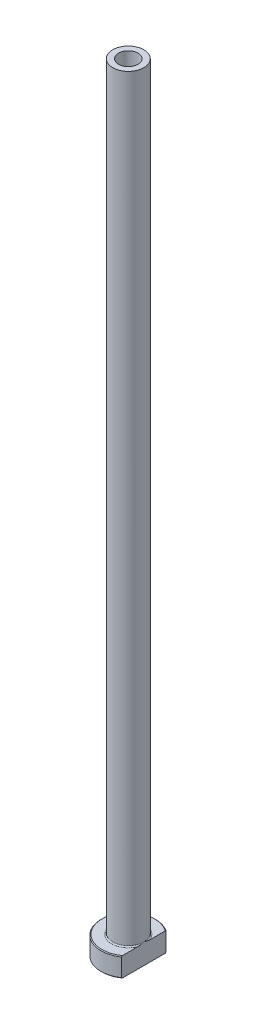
ISO-10303-21;
HEADER;
FILE_DESCRIPTION(('STEP AP214'),'2;1');
FILE_NAME('part.step','',(''),(''),'','','');
FILE_SCHEMA(('AUTOMOTIVE_DESIGN { 1 0 10303 214 1 1 1 1 }'));
ENDSEC;
DATA;
#1=APPLICATION_CONTEXT('core data for automotive mechanical design processes');
#2=APPLICATION_PROTOCOL_DEFINITION('international standard','automotive_design',2000,#1);
#3=PRODUCT_CONTEXT('',#1,'mechanical');
#4=PRODUCT('Part','Part','',(#3));
#5=PRODUCT_RELATED_PRODUCT_CATEGORY('part','',(#4));
#6=PRODUCT_DEFINITION_FORMATION('','',#4);
#7=PRODUCT_DEFINITION_CONTEXT('part definition',#1,'design');
#8=PRODUCT_DEFINITION('design','',#6,#7);
#9=PRODUCT_DEFINITION_SHAPE('','',#8);
#10=(LENGTH_UNIT() NAMED_UNIT(*) SI_UNIT(.MILLI.,.METRE.));
#11=(NAMED_UNIT(*) PLANE_ANGLE_UNIT() SI_UNIT($,.RADIAN.));
#12=(NAMED_UNIT(*) SI_UNIT($,.STERADIAN.) SOLID_ANGLE_UNIT());
#13=UNCERTAINTY_MEASURE_WITH_UNIT(LENGTH_MEASURE(1.E-05),#10,'distance_accuracy_value','');
#14=(GEOMETRIC_REPRESENTATION_CONTEXT(3) GLOBAL_UNCERTAINTY_ASSIGNED_CONTEXT((#13)) GLOBAL_UNIT_ASSIGNED_CONTEXT((#10,
#11,#12)) REPRESENTATION_CONTEXT('',''));
#15=CARTESIAN_POINT('',(0.,0.,0.));
#16=DIRECTION('',(0.,0.,1.));
#17=DIRECTION('',(1.,0.,0.));
#18=AXIS2_PLACEMENT_3D('',#15,#16,#17);
#19=CARTESIAN_POINT('',(0.,92.1876809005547,0.));
#20=DIRECTION('',(0.,1.,0.));
#21=DIRECTION('',(0.,0.,1.));
#22=AXIS2_PLACEMENT_3D('',#19,#20,#21);
#23=CYLINDRICAL_SURFACE('',#22,2.5);
#24=CARTESIAN_POINT('',(0.,200.,0.));
#25=DIRECTION('',(0.,1.,0.));
#26=DIRECTION('',(0.,0.,1.));
#27=AXIS2_PLACEMENT_3D('',#24,#25,#26);
#28=CIRCLE('',#27,2.5);
#29=CARTESIAN_POINT('',(0.,200.,2.5));
#30=VERTEX_POINT('',#29);
#31=EDGE_CURVE('E167',#30,#30,#28,.T.);
#32=ORIENTED_EDGE('',*,*,#31,.T.);
#33=EDGE_LOOP('',(#32));
#34=FACE_BOUND('',#33,.T.);
#35=CARTESIAN_POINT('',(0.,155.,0.));
#36=DIRECTION('',(0.,1.,0.));
#37=DIRECTION('',(0.,0.,1.));
#38=AXIS2_PLACEMENT_3D('',#35,#36,#37);
#39=CIRCLE('',#38,2.5);
#40=CARTESIAN_POINT('',(0.,155.,2.5));
#41=VERTEX_POINT('',#40);
#42=EDGE_CURVE('E170',#41,#41,#39,.T.);
#43=ORIENTED_EDGE('',*,*,#42,.F.);
#44=EDGE_LOOP('',(#43));
#45=FACE_BOUND('',#44,.T.);
#46=ADVANCED_FACE('F32',(#34,#45),#23,.F.);
#47=CARTESIAN_POINT('',(-2.5,200.,0.));
#48=DIRECTION('',(0.,1.,0.));
#49=DIRECTION('',(0.,0.,1.));
#50=AXIS2_PLACEMENT_3D('',#47,#48,#49);
#51=PLANE('',#50);
#52=CARTESIAN_POINT('',(0.,200.,0.));
#53=DIRECTION('',(0.,1.,0.));
#54=DIRECTION('',(0.,0.,1.));
#55=AXIS2_PLACEMENT_3D('',#52,#53,#54);
#56=CIRCLE('',#55,4.00000000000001);
#57=CARTESIAN_POINT('',(0.,200.,4.00000000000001));
#58=VERTEX_POINT('',#57);
#59=EDGE_CURVE('E174',#58,#58,#56,.T.);
#60=ORIENTED_EDGE('',*,*,#59,.T.);
#61=EDGE_LOOP('',(#60));
#62=FACE_BOUND('',#61,.T.);
#63=ORIENTED_EDGE('',*,*,#31,.F.);
#64=EDGE_LOOP('',(#63));
#65=FACE_BOUND('',#64,.T.);
#66=ADVANCED_FACE('F157',(#62,#65),#51,.T.);
#67=CARTESIAN_POINT('',(0.,92.1876809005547,0.));
#68=DIRECTION('',(0.,1.,0.));
#69=DIRECTION('',(0.,0.,1.));
#70=AXIS2_PLACEMENT_3D('',#67,#68,#69);
#71=CYLINDRICAL_SURFACE('',#70,4.);
#72=CARTESIAN_POINT('',(0.,5.3,0.));
#73=DIRECTION('',(0.,1.,0.));
#74=DIRECTION('',(0.,0.,1.));
#75=AXIS2_PLACEMENT_3D('',#72,#73,#74);
#76=CIRCLE('',#75,4.);
#77=CARTESIAN_POINT('',(4.,5.3,0.));
#78=VERTEX_POINT('',#77);
#79=EDGE_CURVE('E180',#78,#78,#76,.T.);
#80=ORIENTED_EDGE('',*,*,#79,.T.);
#81=EDGE_LOOP('',(#80));
#82=FACE_BOUND('',#81,.T.);
#83=ORIENTED_EDGE('',*,*,#59,.F.);
#84=EDGE_LOOP('',(#83));
#85=FACE_BOUND('',#84,.T.);
#86=ADVANCED_FACE('F162',(#82,#85),#71,.T.);
#87=CARTESIAN_POINT('',(-3.99999999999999,5.,0.));
#88=DIRECTION('',(0.,1.,0.));
#89=DIRECTION('',(0.,0.,1.));
#90=AXIS2_PLACEMENT_3D('',#87,#88,#89);
#91=PLANE('',#90);
#92=DIRECTION('',(0.,0.,1.));
#93=VECTOR('',#92,1.);
#94=CARTESIAN_POINT('',(4.,5.,0.));
#95=LINE('',#94,#93);
#96=CARTESIAN_POINT('',(4.,5.,-5.49909083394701));
#97=VERTEX_POINT('',#96);
#98=CARTESIAN_POINT('',(4.,5.,-1.57797338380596));
#99=VERTEX_POINT('',#98);
#100=EDGE_CURVE('E54',#97,#99,#95,.T.);
#101=ORIENTED_EDGE('',*,*,#100,.F.);
#102=CARTESIAN_POINT('',(0.,5.,0.));
#103=DIRECTION('',(0.,1.,0.));
#104=DIRECTION('',(0.,0.,1.));
#105=AXIS2_PLACEMENT_3D('',#102,#103,#104);
#106=CIRCLE('',#105,6.8);
#107=CARTESIAN_POINT('',(3.99999999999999,5.,5.49909083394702));
#108=VERTEX_POINT('',#107);
#109=EDGE_CURVE('E186',#97,#108,#106,.T.);
#110=ORIENTED_EDGE('',*,*,#109,.T.);
#111=CARTESIAN_POINT('',(4.,5.,1.57797338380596));
#112=VERTEX_POINT('',#111);
#113=EDGE_CURVE('E134',#112,#108,#95,.T.);
#114=ORIENTED_EDGE('',*,*,#113,.F.);
#115=CARTESIAN_POINT('',(0.,5.,0.));
#116=DIRECTION('',(0.,1.,0.));
#117=DIRECTION('',(0.,0.,1.));
#118=AXIS2_PLACEMENT_3D('',#115,#116,#117);
#119=CIRCLE('',#118,4.3);
#120=EDGE_CURVE('E183',#112,#99,#119,.F.);
#121=ORIENTED_EDGE('',*,*,#120,.T.);
#122=EDGE_LOOP('',(#101,#110,#114,#121));
#123=FACE_BOUND('',#122,.T.);
#124=ADVANCED_FACE('F197',(#123),#91,.T.);
#125=CARTESIAN_POINT('',(0.,92.1876809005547,0.));
#126=DIRECTION('',(0.,1.,0.));
#127=DIRECTION('',(0.,0.,1.));
#128=AXIS2_PLACEMENT_3D('',#125,#126,#127);
#129=CYLINDRICAL_SURFACE('',#128,6.99999999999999);
#130=DIRECTION('',(0.,-1.,0.));
#131=VECTOR('',#130,1.);
#132=CARTESIAN_POINT('',(3.99999999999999,200.,5.74456264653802));
#133=LINE('',#132,#131);
#134=CARTESIAN_POINT('',(3.99999999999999,4.8,5.74456264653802));
#135=VERTEX_POINT('',#134);
#136=CARTESIAN_POINT('',(3.99999999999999,0.20000000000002,5.74456264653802));
#137=VERTEX_POINT('',#136);
#138=EDGE_CURVE('E82',#135,#137,#133,.T.);
#139=ORIENTED_EDGE('',*,*,#138,.F.);
#140=CARTESIAN_POINT('',(0.,4.8,0.));
#141=DIRECTION('',(0.,1.,0.));
#142=DIRECTION('',(0.,0.,1.));
#143=AXIS2_PLACEMENT_3D('',#140,#141,#142);
#144=CIRCLE('',#143,6.99999999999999);
#145=CARTESIAN_POINT('',(4.,4.8,-5.74456264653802));
#146=VERTEX_POINT('',#145);
#147=EDGE_CURVE('E95',#135,#146,#144,.F.);
#148=ORIENTED_EDGE('',*,*,#147,.T.);
#149=DIRECTION('',(0.,-1.,0.));
#150=VECTOR('',#149,1.);
#151=CARTESIAN_POINT('',(4.,200.,-5.74456264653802));
#152=LINE('',#151,#150);
#153=CARTESIAN_POINT('',(4.,0.20000000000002,-5.74456264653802));
#154=VERTEX_POINT('',#153);
#155=EDGE_CURVE('E192',#146,#154,#152,.T.);
#156=ORIENTED_EDGE('',*,*,#155,.T.);
#157=CARTESIAN_POINT('',(0.,0.20000000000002,0.));
#158=DIRECTION('',(0.,-1.,0.));
#159=DIRECTION('',(0.,0.,-1.));
#160=AXIS2_PLACEMENT_3D('',#157,#158,#159);
#161=CIRCLE('',#160,6.99999999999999);
#162=EDGE_CURVE('E98',#154,#137,#161,.F.);
#163=ORIENTED_EDGE('',*,*,#162,.T.);
#164=EDGE_LOOP('',(#139,#148,#156,#163));
#165=FACE_BOUND('',#164,.T.);
#166=ADVANCED_FACE('F190',(#165),#129,.T.);
#167=CARTESIAN_POINT('',(-6.99999999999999,0.,0.));
#168=DIRECTION('',(0.,-1.,0.));
#169=DIRECTION('',(0.,0.,-1.));
#170=AXIS2_PLACEMENT_3D('',#167,#168,#169);
#171=PLANE('',#170);
#172=CARTESIAN_POINT('',(0.,0.,0.));
#173=DIRECTION('',(0.,-1.,0.));
#174=DIRECTION('',(0.,0.,-1.));
#175=AXIS2_PLACEMENT_3D('',#172,#173,#174);
#176=CIRCLE('',#175,3.25);
#177=CARTESIAN_POINT('',(0.,0.,-3.25));
#178=VERTEX_POINT('',#177);
#179=EDGE_CURVE('E40',#178,#178,#176,.F.);
#180=ORIENTED_EDGE('',*,*,#179,.T.);
#181=EDGE_LOOP('',(#180));
#182=FACE_BOUND('',#181,.T.);
#183=DIRECTION('',(0.,0.,-1.));
#184=VECTOR('',#183,1.);
#185=CARTESIAN_POINT('',(3.99999999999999,0.,5.74456264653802));
#186=LINE('',#185,#184);
#187=CARTESIAN_POINT('',(3.99999999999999,0.,5.49909083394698));
#188=VERTEX_POINT('',#187);
#189=CARTESIAN_POINT('',(4.,0.,-5.49909083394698));
#190=VERTEX_POINT('',#189);
#191=EDGE_CURVE('E47',#188,#190,#186,.T.);
#192=ORIENTED_EDGE('',*,*,#191,.F.);
#193=CARTESIAN_POINT('',(0.,0.,0.));
#194=DIRECTION('',(0.,-1.,0.));
#195=DIRECTION('',(0.,0.,-1.));
#196=AXIS2_PLACEMENT_3D('',#193,#194,#195);
#197=CIRCLE('',#196,6.79999999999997);
#198=EDGE_CURVE('E92',#188,#190,#197,.T.);
#199=ORIENTED_EDGE('',*,*,#198,.T.);
#200=EDGE_LOOP('',(#192,#199));
#201=FACE_BOUND('',#200,.T.);
#202=ADVANCED_FACE('F91',(#182,#201),#171,.T.);
#203=CARTESIAN_POINT('',(0.,92.1876809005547,0.));
#204=DIRECTION('',(0.,1.,0.));
#205=DIRECTION('',(0.,0.,1.));
#206=AXIS2_PLACEMENT_3D('',#203,#204,#205);
#207=CYLINDRICAL_SURFACE('',#206,2.75);
#208=CARTESIAN_POINT('',(0.,0.500000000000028,0.));
#209=DIRECTION('',(0.,-1.,0.));
#210=DIRECTION('',(0.,0.,-1.));
#211=AXIS2_PLACEMENT_3D('',#208,#209,#210);
#212=CIRCLE('',#211,2.75);
#213=CARTESIAN_POINT('',(0.,0.500000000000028,-2.75));
#214=VERTEX_POINT('',#213);
#215=EDGE_CURVE('E11',#214,#214,#212,.T.);
#216=ORIENTED_EDGE('',*,*,#215,.T.);
#217=EDGE_LOOP('',(#216));
#218=FACE_BOUND('',#217,.T.);
#219=CARTESIAN_POINT('',(0.,143.,0.));
#220=DIRECTION('',(0.,1.,0.));
#221=DIRECTION('',(0.,0.,1.));
#222=AXIS2_PLACEMENT_3D('',#219,#220,#221);
#223=CIRCLE('',#222,2.75000000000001);
#224=CARTESIAN_POINT('',(0.,143.,2.75000000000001));
#225=VERTEX_POINT('',#224);
#226=EDGE_CURVE('E172',#225,#225,#223,.T.);
#227=ORIENTED_EDGE('',*,*,#226,.T.);
#228=EDGE_LOOP('',(#227));
#229=FACE_BOUND('',#228,.T.);
#230=ADVANCED_FACE('F215',(#218,#229),#207,.F.);
#231=CARTESIAN_POINT('',(0.,143.,0.));
#232=DIRECTION('',(0.,-1.,0.));
#233=DIRECTION('',(0.,0.,-1.));
#234=AXIS2_PLACEMENT_3D('',#231,#232,#233);
#235=CONICAL_SURFACE('',#234,2.75000000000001,0.0208303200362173);
#236=ORIENTED_EDGE('',*,*,#42,.T.);
#237=EDGE_LOOP('',(#236));
#238=FACE_BOUND('',#237,.T.);
#239=ORIENTED_EDGE('',*,*,#226,.F.);
#240=EDGE_LOOP('',(#239));
#241=FACE_BOUND('',#240,.T.);
#242=ADVANCED_FACE('F111',(#238,#241),#235,.F.);
#243=CARTESIAN_POINT('',(0.,5.3,0.));
#244=DIRECTION('',(0.,1.,0.));
#245=DIRECTION('',(0.,0.,1.));
#246=AXIS2_PLACEMENT_3D('',#243,#244,#245);
#247=TOROIDAL_SURFACE('',#246,4.3,0.3);
#248=ORIENTED_EDGE('',*,*,#120,.F.);
#249=CARTESIAN_POINT('',(4.,5.3,0.));
#250=CARTESIAN_POINT('',(4.,5.30000062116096,-1.06261387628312E-10));
#251=CARTESIAN_POINT('',(4.,5.30000124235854,2.17726101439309E-07));
#252=CARTESIAN_POINT('',(4.,5.30000240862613,8.36141079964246E-07));
#253=CARTESIAN_POINT('',(4.,5.30000294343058,1.25011689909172E-06));
#254=CARTESIAN_POINT('',(4.,5.30000404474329,2.23959350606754E-06));
#255=CARTESIAN_POINT('',(4.,5.30000459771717,2.83084478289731E-06));
#256=CARTESIAN_POINT('',(4.,5.30000559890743,4.06516620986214E-06));
#257=CARTESIAN_POINT('',(4.,5.30000604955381,4.70640099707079E-06));
#258=CARTESIAN_POINT('',(4.,5.3000076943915,7.15677236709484E-06));
#259=CARTESIAN_POINT('',(4.,5.30000879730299,9.02996012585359E-06));
#260=CARTESIAN_POINT('',(4.,5.30001063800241,1.27664891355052E-05));
#261=CARTESIAN_POINT('',(4.,5.30001139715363,1.46197810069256E-05));
#262=CARTESIAN_POINT('',(4.,5.30001453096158,2.23679229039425E-05));
#263=CARTESIAN_POINT('',(4.,5.30001683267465,2.82968759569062E-05));
#264=CARTESIAN_POINT('',(4.,5.30002027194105,3.95668741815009E-05));
#265=CARTESIAN_POINT('',(4.,5.30002152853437,4.48715472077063E-05));
#266=CARTESIAN_POINT('',(4.,5.30003060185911,8.40118217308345E-05));
#267=CARTESIAN_POINT('',(4.,5.30003739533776,0.000118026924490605));
#268=CARTESIAN_POINT('',(4.,5.30006713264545,0.000252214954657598));
#269=CARTESIAN_POINT('',(4.,5.30009559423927,0.000351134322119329));
#270=CARTESIAN_POINT('',(3.99999999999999,5.30020622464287,0.000742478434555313));
#271=CARTESIAN_POINT('',(4.,5.30028475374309,0.00103561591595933));
#272=CARTESIAN_POINT('',(4.,5.30059889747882,0.00219920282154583));
#273=CARTESIAN_POINT('',(4.,5.30083905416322,0.00306873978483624));
#274=CARTESIAN_POINT('',(3.99999999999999,5.30183682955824,0.00669141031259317));
#275=CARTESIAN_POINT('',(4.,5.30258877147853,0.00944568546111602));
#276=CARTESIAN_POINT('',(4.,5.31066890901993,0.0390293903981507));
#277=CARTESIAN_POINT('',(4.,5.31802631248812,0.0658531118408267));
#278=CARTESIAN_POINT('',(3.99999999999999,5.33239676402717,0.118441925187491));
#279=CARTESIAN_POINT('',(4.,5.3394118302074,0.144206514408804));
#280=CARTESIAN_POINT('',(4.,5.35427366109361,0.19901759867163));
#281=CARTESIAN_POINT('',(4.,5.36211313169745,0.228066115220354));
#282=CARTESIAN_POINT('',(4.,5.37776349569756,0.286511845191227));
#283=CARTESIAN_POINT('',(4.,5.38557313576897,0.315909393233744));
#284=CARTESIAN_POINT('',(4.,5.40425662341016,0.386994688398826));
#285=CARTESIAN_POINT('',(4.,5.41505237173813,0.428703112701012));
#286=CARTESIAN_POINT('',(4.,5.43592310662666,0.511098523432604));
#287=CARTESIAN_POINT('',(4.,5.4460096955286,0.551782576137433));
#288=CARTESIAN_POINT('',(4.,5.47850986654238,0.686599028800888));
#289=CARTESIAN_POINT('',(4.,5.49978370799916,0.78101186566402));
#290=CARTESIAN_POINT('',(4.,5.53807543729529,0.971847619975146));
#291=CARTESIAN_POINT('',(4.,5.55504273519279,1.06828120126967));
#292=CARTESIAN_POINT('',(4.,5.5758240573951,1.21752725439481));
#293=CARTESIAN_POINT('',(4.,5.5820979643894,1.26999379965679));
#294=CARTESIAN_POINT('',(4.,5.59210686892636,1.37516324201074));
#295=CARTESIAN_POINT('',(4.,5.59584265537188,1.42786606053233));
#296=CARTESIAN_POINT('',(4.,5.60010438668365,1.53310673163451));
#297=CARTESIAN_POINT('',(4.,5.6006487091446,1.58564378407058));
#298=CARTESIAN_POINT('',(4.,5.59767158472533,1.69058605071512));
#299=CARTESIAN_POINT('',(4.,5.59415502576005,1.74299134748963));
#300=CARTESIAN_POINT('',(4.,5.58503062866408,1.81903290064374));
#301=CARTESIAN_POINT('',(4.,5.58157617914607,1.84292934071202));
#302=CARTESIAN_POINT('',(4.,5.57329952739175,1.89051061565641));
#303=CARTESIAN_POINT('',(4.,5.56847619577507,1.91419525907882));
#304=CARTESIAN_POINT('',(4.,5.55726644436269,1.9609288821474));
#305=CARTESIAN_POINT('',(4.,5.550897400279,1.98398195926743));
#306=CARTESIAN_POINT('',(4.,5.53623434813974,2.02945550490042));
#307=CARTESIAN_POINT('',(4.,5.52794253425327,2.05187666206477));
#308=CARTESIAN_POINT('',(4.,5.50887098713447,2.09590631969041));
#309=CARTESIAN_POINT('',(4.,5.49806837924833,2.11750508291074));
#310=CARTESIAN_POINT('',(4.,5.47333401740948,2.15885583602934));
#311=CARTESIAN_POINT('',(4.,5.459412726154,2.17861369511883));
#312=CARTESIAN_POINT('',(4.,5.43588221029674,2.20522942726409));
#313=CARTESIAN_POINT('',(4.,5.42781139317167,2.21344043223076));
#314=CARTESIAN_POINT('',(4.,5.41065114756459,2.22875149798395));
#315=CARTESIAN_POINT('',(4.,5.4015612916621,2.23585108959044));
#316=CARTESIAN_POINT('',(4.,5.38220524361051,2.24859694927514));
#317=CARTESIAN_POINT('',(4.,5.37192420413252,2.25422119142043));
#318=CARTESIAN_POINT('',(4.,5.35045072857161,2.26331064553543));
#319=CARTESIAN_POINT('',(4.,5.33926122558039,2.26678251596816));
#320=CARTESIAN_POINT('',(4.,5.3195204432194,2.2705126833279));
#321=CARTESIAN_POINT('',(4.,5.31108453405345,2.27139016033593));
#322=CARTESIAN_POINT('',(4.,5.29418624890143,2.27168963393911));
#323=CARTESIAN_POINT('',(4.,5.2857238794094,2.27111196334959));
#324=CARTESIAN_POINT('',(4.,5.26904138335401,2.26855580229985));
#325=CARTESIAN_POINT('',(4.,5.26082066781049,2.26658107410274));
#326=CARTESIAN_POINT('',(4.,5.24478214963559,2.26139496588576));
#327=CARTESIAN_POINT('',(4.,5.23696461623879,2.25818277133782));
#328=CARTESIAN_POINT('',(4.,5.2185123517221,2.24908332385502));
#329=CARTESIAN_POINT('',(4.,5.20815219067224,2.24264095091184));
#330=CARTESIAN_POINT('',(4.,5.18857975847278,2.22819957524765));
#331=CARTESIAN_POINT('',(4.,5.17937061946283,2.22019647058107));
#332=CARTESIAN_POINT('',(4.,5.15665383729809,2.19777756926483));
#333=CARTESIAN_POINT('',(4.,5.14403484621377,2.18246908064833));
#334=CARTESIAN_POINT('',(4.,5.12118369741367,2.15020843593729));
#335=CARTESIAN_POINT('',(4.,5.11095480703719,2.13325407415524));
#336=CARTESIAN_POINT('',(4.,5.09273574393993,2.09892324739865));
#337=CARTESIAN_POINT('',(4.,5.08468212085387,2.08157988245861));
#338=CARTESIAN_POINT('',(4.,5.07005901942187,2.04627072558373));
#339=CARTESIAN_POINT('',(4.,5.06349101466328,2.02830433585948));
#340=CARTESIAN_POINT('',(4.,5.04555485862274,1.9735076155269));
#341=CARTESIAN_POINT('',(4.,5.03608974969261,1.93605770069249));
#342=CARTESIAN_POINT('',(4.,5.01780569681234,1.84529235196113));
#343=CARTESIAN_POINT('',(4.,5.01077018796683,1.79164082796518));
#344=CARTESIAN_POINT('',(4.,5.00182846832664,1.68379947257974));
#345=CARTESIAN_POINT('',(4.,4.99993887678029,1.62960846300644));
#346=CARTESIAN_POINT('',(4.,5.0000612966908,1.52361204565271));
#347=CARTESIAN_POINT('',(4.,5.00190698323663,1.47180551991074));
#348=CARTESIAN_POINT('',(4.,5.00841243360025,1.36835357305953));
#349=CARTESIAN_POINT('',(4.,5.01307376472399,1.31670825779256));
#350=CARTESIAN_POINT('',(4.,5.02905484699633,1.17431887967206));
#351=CARTESIAN_POINT('',(4.,5.04274090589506,1.08384207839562));
#352=CARTESIAN_POINT('',(4.,5.06701714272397,0.9477579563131));
#353=CARTESIAN_POINT('',(4.,5.07585573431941,0.90181406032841));
#354=CARTESIAN_POINT('',(4.,5.09458665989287,0.810008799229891));
#355=CARTESIAN_POINT('',(4.,5.10448180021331,0.764148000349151));
#356=CARTESIAN_POINT('',(4.,5.12892434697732,0.655631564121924));
#357=CARTESIAN_POINT('',(4.,5.14383556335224,0.593058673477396));
#358=CARTESIAN_POINT('',(4.,5.17458762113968,0.468885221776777));
#359=CARTESIAN_POINT('',(4.,5.19041623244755,0.407281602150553));
#360=CARTESIAN_POINT('',(3.99999999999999,5.22090834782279,0.291232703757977));
#361=CARTESIAN_POINT('',(3.99999999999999,5.23550024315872,0.236768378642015));
#362=CARTESIAN_POINT('',(4.,5.26562550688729,0.125604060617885));
#363=CARTESIAN_POINT('',(4.,5.28117250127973,0.0689076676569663));
#364=CARTESIAN_POINT('',(4.,5.29741226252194,0.00944154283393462));
#365=CARTESIAN_POINT('',(3.99999999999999,5.29816540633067,0.0066831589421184));
#366=CARTESIAN_POINT('',(4.,5.29916346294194,0.0030595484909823));
#367=CARTESIAN_POINT('',(4.,5.2994027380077,0.00219318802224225));
#368=CARTESIAN_POINT('',(4.,5.29971580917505,0.00103357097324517));
#369=CARTESIAN_POINT('',(3.99999999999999,5.29979412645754,0.000741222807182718));
#370=CARTESIAN_POINT('',(4.,5.29990450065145,0.00035080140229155));
#371=CARTESIAN_POINT('',(4.,5.29993292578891,0.000252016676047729));
#372=CARTESIAN_POINT('',(4.,5.2999626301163,0.000117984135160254));
#373=CARTESIAN_POINT('',(4.,5.29996941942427,8.39881910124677E-05));
#374=CARTESIAN_POINT('',(4.,5.29997848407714,4.48674022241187E-05));
#375=CARTESIAN_POINT('',(4.,5.29997973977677,3.95638197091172E-05));
#376=CARTESIAN_POINT('',(4.,5.29998317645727,2.82960343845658E-05));
#377=CARTESIAN_POINT('',(4.,5.29998547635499,2.23681459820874E-05));
#378=CARTESIAN_POINT('',(4.,5.2999886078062,1.46211003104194E-05));
#379=CARTESIAN_POINT('',(4.,5.29998936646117,1.27678901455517E-05));
#380=CARTESIAN_POINT('',(4.,5.29999120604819,9.03144064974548E-06));
#381=CARTESIAN_POINT('',(4.,5.29999230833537,7.15824096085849E-06));
#382=CARTESIAN_POINT('',(4.,5.29999395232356,4.70775527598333E-06));
#383=CARTESIAN_POINT('',(4.,5.29999440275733,4.06646391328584E-06));
#384=CARTESIAN_POINT('',(4.,5.29999540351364,2.83199096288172E-06));
#385=CARTESIAN_POINT('',(4.,5.29999595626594,2.24064351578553E-06));
#386=CARTESIAN_POINT('',(4.,5.29999705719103,1.25093979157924E-06));
#387=CARTESIAN_POINT('',(4.,5.29999759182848,8.36841135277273E-07));
#388=CARTESIAN_POINT('',(4.,5.29999875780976,2.18117782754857E-07));
#389=CARTESIAN_POINT('',(4.,5.29999937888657,1.06254464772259E-10));
#390=CARTESIAN_POINT('',(4.,5.3,0.));
#391=B_SPLINE_CURVE_WITH_KNOTS('',3,(#249,#250,#251,#252,#253,#254,#255,#256,#257,#258,#259,
#260,#261,#262,#263,#264,#265,#266,#267,#268,#269,#270,#271,#272,#273,#274,#275,#276,#277,#278,
#279,#280,#281,#282,#283,#284,#285,#286,#287,#288,#289,#290,#291,#292,#293,#294,#295,#296,#297,
#298,#299,#300,#301,#302,#303,#304,#305,#306,#307,#308,#309,#310,#311,#312,#313,#314,#315,#316,
#317,#318,#319,#320,#321,#322,#323,#324,#325,#326,#327,#328,#329,#330,#331,#332,#333,#334,#335,
#336,#337,#338,#339,#340,#341,#342,#343,#344,#345,#346,#347,#348,#349,#350,#351,#352,#353,#354,
#355,#356,#357,#358,#359,#360,#361,#362,#363,#364,#365,#366,#367,#368,#369,#370,#371,#372,#373,
#374,#375,#376,#377,#378,#379,#380,#381,#382,#383,#384,#385,#386,#387,#388,#389,#390),
.UNSPECIFIED.,.T.,.F.,(4,2,2,2,2,2,2,2,2,2,2,2,2,2,2,2,2,2,2,2,2,2,2,2,2,2,2,2,2,2,2,2,2,2,2,2,
2,2,2,2,2,2,2,2,2,2,2,2,2,2,2,2,2,2,2,2,2,2,2,2,2,2,2,2,2,2,2,2,2,2,4),(0.,1.87484395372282E-06,
3.90179990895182E-06,6.31683803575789E-06,8.66651934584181E-06,1.51627551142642E-05,
2.11657928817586E-05,4.02090773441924E-05,5.65429468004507E-05,0.000160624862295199,
0.000469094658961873,0.00137985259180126,0.0040857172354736,0.0126514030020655,
0.0960918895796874,0.176200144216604,0.266463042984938,0.357714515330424,0.486961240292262,
0.612707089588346,0.902988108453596,1.19653589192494,1.35501075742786,1.51343634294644,
1.67094875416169,1.82827177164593,1.90067591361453,1.97313996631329,2.04482437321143,
2.11642737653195,2.18871023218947,2.26075412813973,2.29521947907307,2.32969934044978,
2.36466792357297,2.39952778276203,2.4248542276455,2.45017488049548,2.47542760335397,
2.5006969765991,2.53708899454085,2.57357798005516,2.63276032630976,2.69202310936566,
2.74930315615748,2.80663977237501,2.92223125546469,3.08420752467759,3.24670629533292,
3.4021285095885,3.55763731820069,3.83192962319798,3.9722838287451,4.11302057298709,
4.30598130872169,4.4967888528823,4.66594443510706,4.84230602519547,4.85088453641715,
4.85358051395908,4.85448881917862,4.85479687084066,4.85490089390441,4.85491722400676,
4.85493626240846,4.85494226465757,4.85494875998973,4.85495110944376,4.85495352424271,
4.85495555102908,4.85495742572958),.UNSPECIFIED.);
#392=EDGE_CURVE('E126',#112,#78,#391,.T.);
#393=ORIENTED_EDGE('',*,*,#392,.T.);
#394=ORIENTED_EDGE('',*,*,#79,.F.);
#395=CARTESIAN_POINT('',(4.,5.3,0.));
#396=CARTESIAN_POINT('',(4.,5.29999937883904,1.06262478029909E-10));
#397=CARTESIAN_POINT('',(4.,5.29999875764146,-2.17726100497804E-07));
#398=CARTESIAN_POINT('',(4.,5.29999759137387,-8.36141079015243E-07));
#399=CARTESIAN_POINT('',(4.,5.29999705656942,-1.25011689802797E-06));
#400=CARTESIAN_POINT('',(4.,5.29999595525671,-2.2395935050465E-06));
#401=CARTESIAN_POINT('',(4.,5.29999540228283,-2.83084478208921E-06));
#402=CARTESIAN_POINT('',(4.,5.29999440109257,-4.06516620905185E-06));
#403=CARTESIAN_POINT('',(4.,5.29999395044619,-4.70640099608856E-06));
#404=CARTESIAN_POINT('',(4.,5.2999923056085,-7.15677236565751E-06));
#405=CARTESIAN_POINT('',(4.,5.29999120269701,-9.02996012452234E-06));
#406=CARTESIAN_POINT('',(4.,5.29998936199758,-1.27664891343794E-05));
#407=CARTESIAN_POINT('',(4.,5.29998860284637,-1.46197810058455E-05));
#408=CARTESIAN_POINT('',(4.,5.29998546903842,-2.23679229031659E-05));
#409=CARTESIAN_POINT('',(4.,5.29998316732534,-2.82968759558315E-05));
#410=CARTESIAN_POINT('',(4.,5.29997972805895,-3.95668741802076E-05));
#411=CARTESIAN_POINT('',(4.,5.29997847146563,-4.48715472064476E-05));
#412=CARTESIAN_POINT('',(4.,5.29996939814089,-8.40118217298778E-05));
#413=CARTESIAN_POINT('',(4.,5.29996260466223,-0.000118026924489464));
#414=CARTESIAN_POINT('',(4.,5.29993286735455,-0.000252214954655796));
#415=CARTESIAN_POINT('',(4.,5.29990440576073,-0.000351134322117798));
#416=CARTESIAN_POINT('',(3.99999999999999,5.29979377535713,-0.000742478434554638));
#417=CARTESIAN_POINT('',(4.,5.29971524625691,-0.00103561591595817));
#418=CARTESIAN_POINT('',(4.,5.29940110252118,-0.0021992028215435));
#419=CARTESIAN_POINT('',(4.,5.29916094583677,-0.00306873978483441));
#420=CARTESIAN_POINT('',(3.99999999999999,5.29816317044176,-0.00669141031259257));
#421=CARTESIAN_POINT('',(4.,5.29741122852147,-0.00944568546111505));
#422=CARTESIAN_POINT('',(4.,5.28933109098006,-0.0390293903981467));
#423=CARTESIAN_POINT('',(4.,5.28197368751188,-0.0658531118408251));
#424=CARTESIAN_POINT('',(3.99999999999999,5.26760323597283,-0.118441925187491));
#425=CARTESIAN_POINT('',(4.,5.2605881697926,-0.144206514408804));
#426=CARTESIAN_POINT('',(4.,5.24572633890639,-0.19901759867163));
#427=CARTESIAN_POINT('',(4.,5.23788686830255,-0.228066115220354));
#428=CARTESIAN_POINT('',(4.,5.22223650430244,-0.286511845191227));
#429=CARTESIAN_POINT('',(4.,5.21442686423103,-0.315909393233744));
#430=CARTESIAN_POINT('',(4.,5.19574337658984,-0.386994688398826));
#431=CARTESIAN_POINT('',(4.,5.18494762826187,-0.428703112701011));
#432=CARTESIAN_POINT('',(4.,5.16407689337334,-0.511098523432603));
#433=CARTESIAN_POINT('',(4.,5.1539903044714,-0.551782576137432));
#434=CARTESIAN_POINT('',(4.,5.12149013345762,-0.686599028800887));
#435=CARTESIAN_POINT('',(4.,5.10021629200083,-0.781011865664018));
#436=CARTESIAN_POINT('',(4.,5.06192456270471,-0.971847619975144));
#437=CARTESIAN_POINT('',(4.,5.04495726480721,-1.06828120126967));
#438=CARTESIAN_POINT('',(4.,5.0241759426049,-1.2175272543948));
#439=CARTESIAN_POINT('',(4.,5.0179020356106,-1.26999379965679));
#440=CARTESIAN_POINT('',(4.,5.00789313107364,-1.37516324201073));
#441=CARTESIAN_POINT('',(4.,5.00415734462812,-1.42786606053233));
#442=CARTESIAN_POINT('',(4.,4.99989561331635,-1.53310673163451));
#443=CARTESIAN_POINT('',(4.,4.9993512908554,-1.58564378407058));
#444=CARTESIAN_POINT('',(4.,5.00232841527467,-1.69058605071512));
#445=CARTESIAN_POINT('',(4.,5.00584497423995,-1.74299134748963));
#446=CARTESIAN_POINT('',(4.,5.01496937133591,-1.81903290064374));
#447=CARTESIAN_POINT('',(4.,5.01842382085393,-1.84292934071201));
#448=CARTESIAN_POINT('',(4.,5.02670047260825,-1.89051061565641));
#449=CARTESIAN_POINT('',(4.,5.03152380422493,-1.91419525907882));
#450=CARTESIAN_POINT('',(4.,5.04273355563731,-1.96092888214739));
#451=CARTESIAN_POINT('',(4.,5.049102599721,-1.98398195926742));
#452=CARTESIAN_POINT('',(4.,5.06376565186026,-2.02945550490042));
#453=CARTESIAN_POINT('',(4.,5.07205746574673,-2.05187666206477));
#454=CARTESIAN_POINT('',(4.,5.09112901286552,-2.0959063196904));
#455=CARTESIAN_POINT('',(4.,5.10193162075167,-2.11750508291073));
#456=CARTESIAN_POINT('',(4.,5.12666598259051,-2.15885583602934));
#457=CARTESIAN_POINT('',(4.,5.140587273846,-2.17861369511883));
#458=CARTESIAN_POINT('',(4.,5.16411778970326,-2.20522942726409));
#459=CARTESIAN_POINT('',(4.,5.17218860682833,-2.21344043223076));
#460=CARTESIAN_POINT('',(4.,5.18934885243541,-2.22875149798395));
#461=CARTESIAN_POINT('',(4.,5.1984387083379,-2.23585108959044));
#462=CARTESIAN_POINT('',(4.,5.21779475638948,-2.24859694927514));
#463=CARTESIAN_POINT('',(4.,5.22807579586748,-2.25422119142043));
#464=CARTESIAN_POINT('',(4.,5.24954927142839,-2.26331064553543));
#465=CARTESIAN_POINT('',(4.,5.26073877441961,-2.26678251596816));
#466=CARTESIAN_POINT('',(4.,5.2804795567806,-2.2705126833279));
#467=CARTESIAN_POINT('',(4.,5.28891546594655,-2.27139016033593));
#468=CARTESIAN_POINT('',(4.,5.30581375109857,-2.27168963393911));
#469=CARTESIAN_POINT('',(4.,5.31427612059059,-2.27111196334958));
#470=CARTESIAN_POINT('',(4.,5.33095861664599,-2.26855580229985));
#471=CARTESIAN_POINT('',(4.,5.33917933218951,-2.26658107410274));
#472=CARTESIAN_POINT('',(4.,5.35521785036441,-2.26139496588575));
#473=CARTESIAN_POINT('',(4.,5.36303538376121,-2.25818277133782));
#474=CARTESIAN_POINT('',(4.,5.38148764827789,-2.24908332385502));
#475=CARTESIAN_POINT('',(4.,5.39184780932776,-2.24264095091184));
#476=CARTESIAN_POINT('',(4.,5.41142024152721,-2.22819957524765));
#477=CARTESIAN_POINT('',(4.,5.42062938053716,-2.22019647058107));
#478=CARTESIAN_POINT('',(4.,5.44334616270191,-2.19777756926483));
#479=CARTESIAN_POINT('',(4.,5.45596515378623,-2.18246908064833));
#480=CARTESIAN_POINT('',(4.,5.47881630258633,-2.15020843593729));
#481=CARTESIAN_POINT('',(4.,5.48904519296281,-2.13325407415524));
#482=CARTESIAN_POINT('',(4.,5.50726425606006,-2.09892324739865));
#483=CARTESIAN_POINT('',(4.,5.51531787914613,-2.08157988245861));
#484=CARTESIAN_POINT('',(4.,5.52994098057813,-2.04627072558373));
#485=CARTESIAN_POINT('',(4.,5.53650898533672,-2.02830433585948));
#486=CARTESIAN_POINT('',(4.,5.55444514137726,-1.9735076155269));
#487=CARTESIAN_POINT('',(4.,5.56391025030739,-1.93605770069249));
#488=CARTESIAN_POINT('',(4.,5.58219430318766,-1.84529235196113));
#489=CARTESIAN_POINT('',(4.,5.58922981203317,-1.79164082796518));
#490=CARTESIAN_POINT('',(4.,5.59817153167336,-1.68379947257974));
#491=CARTESIAN_POINT('',(4.,5.60006112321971,-1.62960846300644));
#492=CARTESIAN_POINT('',(4.,5.5999387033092,-1.52361204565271));
#493=CARTESIAN_POINT('',(4.,5.59809301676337,-1.47180551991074));
#494=CARTESIAN_POINT('',(4.,5.59158756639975,-1.36835357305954));
#495=CARTESIAN_POINT('',(4.,5.58692623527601,-1.31670825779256));
#496=CARTESIAN_POINT('',(4.,5.57094515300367,-1.17431887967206));
#497=CARTESIAN_POINT('',(4.,5.55725909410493,-1.08384207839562));
#498=CARTESIAN_POINT('',(4.,5.53298285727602,-0.947757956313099));
#499=CARTESIAN_POINT('',(4.,5.52414426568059,-0.901814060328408));
#500=CARTESIAN_POINT('',(4.,5.50541334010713,-0.81000879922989));
#501=CARTESIAN_POINT('',(4.,5.49551819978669,-0.764148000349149));
#502=CARTESIAN_POINT('',(4.,5.47107565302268,-0.655631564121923));
#503=CARTESIAN_POINT('',(4.,5.45616443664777,-0.593058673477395));
#504=CARTESIAN_POINT('',(4.,5.42541237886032,-0.468885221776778));
#505=CARTESIAN_POINT('',(4.,5.40958376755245,-0.407281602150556));
#506=CARTESIAN_POINT('',(3.99999999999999,5.37909165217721,-0.291232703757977));
#507=CARTESIAN_POINT('',(3.99999999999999,5.3644997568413,-0.236768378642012));
#508=CARTESIAN_POINT('',(4.,5.33437449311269,-0.12560406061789));
#509=CARTESIAN_POINT('',(4.,5.3188274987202,-0.0689076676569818));
#510=CARTESIAN_POINT('',(4.,5.30258773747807,-0.00944154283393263));
#511=CARTESIAN_POINT('',(3.99999999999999,5.30183459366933,-0.0066831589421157));
#512=CARTESIAN_POINT('',(4.,5.30083653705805,-0.00305954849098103));
#513=CARTESIAN_POINT('',(4.,5.3005972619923,-0.00219318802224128));
#514=CARTESIAN_POINT('',(4.,5.30028419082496,-0.00103357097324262));
#515=CARTESIAN_POINT('',(3.99999999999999,5.30020587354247,-0.000741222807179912));
#516=CARTESIAN_POINT('',(4.,5.30009549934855,-0.000350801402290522));
#517=CARTESIAN_POINT('',(4.,5.30006707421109,-0.000252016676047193));
#518=CARTESIAN_POINT('',(4.,5.3000373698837,-0.000117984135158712));
#519=CARTESIAN_POINT('',(4.,5.30003058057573,-8.39881910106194E-05));
#520=CARTESIAN_POINT('',(4.,5.30002151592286,-4.48674022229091E-05));
#521=CARTESIAN_POINT('',(4.,5.30002026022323,-3.95638197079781E-05));
#522=CARTESIAN_POINT('',(4.,5.30001682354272,-2.8296034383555E-05));
#523=CARTESIAN_POINT('',(4.,5.30001452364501,-2.23681459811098E-05));
#524=CARTESIAN_POINT('',(4.,5.3000113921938,-1.46211003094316E-05));
#525=CARTESIAN_POINT('',(4.,5.30001063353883,-1.27678901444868E-05));
#526=CARTESIAN_POINT('',(4.,5.30000879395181,-9.03144064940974E-06));
#527=CARTESIAN_POINT('',(4.,5.30000769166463,-7.15824096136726E-06));
#528=CARTESIAN_POINT('',(4.,5.30000604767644,-4.70775527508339E-06));
#529=CARTESIAN_POINT('',(4.,5.30000559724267,-4.06646391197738E-06));
#530=CARTESIAN_POINT('',(4.,5.30000459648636,-2.83199096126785E-06));
#531=CARTESIAN_POINT('',(4.,5.30000404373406,-2.24064351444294E-06));
#532=CARTESIAN_POINT('',(4.,5.30000294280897,-1.25093979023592E-06));
#533=CARTESIAN_POINT('',(4.,5.30000240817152,-8.36841133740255E-07));
#534=CARTESIAN_POINT('',(4.,5.30000124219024,-2.1811778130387E-07));
#535=CARTESIAN_POINT('',(4.,5.30000062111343,-1.06253139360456E-10));
#536=CARTESIAN_POINT('',(4.,5.3,0.));
#537=B_SPLINE_CURVE_WITH_KNOTS('',3,(#395,#396,#397,#398,#399,#400,#401,#402,#403,#404,#405,
#406,#407,#408,#409,#410,#411,#412,#413,#414,#415,#416,#417,#418,#419,#420,#421,#422,#423,#424,
#425,#426,#427,#428,#429,#430,#431,#432,#433,#434,#435,#436,#437,#438,#439,#440,#441,#442,#443,
#444,#445,#446,#447,#448,#449,#450,#451,#452,#453,#454,#455,#456,#457,#458,#459,#460,#461,#462,
#463,#464,#465,#466,#467,#468,#469,#470,#471,#472,#473,#474,#475,#476,#477,#478,#479,#480,#481,
#482,#483,#484,#485,#486,#487,#488,#489,#490,#491,#492,#493,#494,#495,#496,#497,#498,#499,#500,
#501,#502,#503,#504,#505,#506,#507,#508,#509,#510,#511,#512,#513,#514,#515,#516,#517,#518,#519,
#520,#521,#522,#523,#524,#525,#526,#527,#528,#529,#530,#531,#532,#533,#534,#535,#536),
.UNSPECIFIED.,.T.,.F.,(4,2,2,2,2,2,2,2,2,2,2,2,2,2,2,2,2,2,2,2,2,2,2,2,2,2,2,2,2,2,2,2,2,2,2,2,
2,2,2,2,2,2,2,2,2,2,2,2,2,2,2,2,2,2,2,2,2,2,2,2,2,2,2,2,2,2,2,2,2,2,4),(0.,1.87484395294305E-06,
3.90179990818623E-06,6.31683803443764E-06,8.66651934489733E-06,1.51627551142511E-05,
2.1165792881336E-05,4.02090773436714E-05,5.65429467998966E-05,0.000160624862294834,
0.000469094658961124,0.00137985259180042,0.00408571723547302,0.0126514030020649,
0.0960918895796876,0.176200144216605,0.266463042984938,0.357714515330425,0.486961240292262,
0.612707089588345,0.902988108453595,1.19653589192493,1.35501075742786,1.51343634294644,
1.67094875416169,1.82827177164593,1.90067591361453,1.97313996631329,2.04482437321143,
2.11642737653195,2.18871023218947,2.26075412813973,2.29521947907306,2.32969934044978,
2.36466792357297,2.39952778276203,2.4248542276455,2.45017488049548,2.47542760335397,
2.5006969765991,2.53708899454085,2.57357798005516,2.63276032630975,2.69202310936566,
2.74930315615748,2.80663977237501,2.92223125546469,3.08420752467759,3.24670629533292,
3.4021285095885,3.55763731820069,3.83192962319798,3.9722838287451,4.11302057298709,
4.30598130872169,4.4967888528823,4.66594443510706,4.84230602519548,4.85088453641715,
4.85358051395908,4.85448881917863,4.85479687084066,4.85490089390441,4.85491722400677,
4.85493626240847,4.85494226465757,4.85494875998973,4.85495110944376,4.85495352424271,
4.85495555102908,4.85495742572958),.UNSPECIFIED.);
#538=EDGE_CURVE('E135',#78,#99,#537,.T.);
#539=ORIENTED_EDGE('',*,*,#538,.T.);
#540=EDGE_LOOP('',(#248,#393,#394,#539));
#541=FACE_BOUND('',#540,.T.);
#542=ADVANCED_FACE('F141',(#541),#247,.F.);
#543=CARTESIAN_POINT('',(0.,5.,0.));
#544=DIRECTION('',(0.,-1.,0.));
#545=DIRECTION('',(0.,0.,-1.));
#546=AXIS2_PLACEMENT_3D('',#543,#544,#545);
#547=CONICAL_SURFACE('',#546,6.8,0.785398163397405);
#548=CARTESIAN_POINT('',(4.,-1.45712845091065,-12.6392822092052));
#549=CARTESIAN_POINT('',(4.,-1.24364466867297,-12.4153556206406));
#550=CARTESIAN_POINT('',(4.,-1.03042430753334,-12.1911774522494));
#551=CARTESIAN_POINT('',(4.,-0.604617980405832,-11.7422167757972));
#552=CARTESIAN_POINT('',(4.,-0.392032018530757,-11.5174342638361));
#553=CARTESIAN_POINT('',(4.,0.0324624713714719,-11.0670952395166));
#554=CARTESIAN_POINT('',(4.,0.244370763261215,-10.8415385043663));
#555=CARTESIAN_POINT('',(4.,0.667290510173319,-10.3895875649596));
#556=CARTESIAN_POINT('',(4.,0.878301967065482,-10.1631933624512));
#557=CARTESIAN_POINT('',(4.,1.51385375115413,-9.47810122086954));
#558=CARTESIAN_POINT('',(4.,1.93676291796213,-9.01788214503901));
#559=CARTESIAN_POINT('',(4.,2.56612335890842,-8.32309905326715));
#560=CARTESIAN_POINT('',(4.,2.77505666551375,-8.09078457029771));
#561=CARTESIAN_POINT('',(4.,3.19080254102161,-7.62426940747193));
#562=CARTESIAN_POINT('',(4.,3.39761512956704,-7.39006874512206));
#563=CARTESIAN_POINT('',(4.,3.87870763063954,-6.83891844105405));
#564=CARTESIAN_POINT('',(4.,4.15190978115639,-6.52102188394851));
#565=CARTESIAN_POINT('',(4.,4.55642425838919,-6.03960901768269));
#566=CARTESIAN_POINT('',(4.,4.69041050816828,-5.87833992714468));
#567=CARTESIAN_POINT('',(4.,4.95616531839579,-5.55398469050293));
#568=CARTESIAN_POINT('',(4.,5.08793391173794,-5.39089857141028));
#569=CARTESIAN_POINT('',(4.,5.3484171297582,-5.06288801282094));
#570=CARTESIAN_POINT('',(4.,5.47713786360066,-4.89796843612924));
#571=CARTESIAN_POINT('',(4.,5.73107494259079,-4.56545535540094));
#572=CARTESIAN_POINT('',(4.,5.85629144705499,-4.39786197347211));
#573=CARTESIAN_POINT('',(4.,6.10211465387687,-4.05948444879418));
#574=CARTESIAN_POINT('',(4.,6.22272435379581,-3.88870249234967));
#575=CARTESIAN_POINT('',(4.,6.45796076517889,-3.54308312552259));
#576=CARTESIAN_POINT('',(4.,6.57258867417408,-3.3682465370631));
#577=CARTESIAN_POINT('',(4.,6.76866603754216,-3.05381396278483));
#578=CARTESIAN_POINT('',(4.,6.85173773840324,-2.91523359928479));
#579=CARTESIAN_POINT('',(4.,7.01174537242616,-2.63451965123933));
#580=CARTESIAN_POINT('',(4.,7.08868042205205,-2.49238555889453));
#581=CARTESIAN_POINT('',(4.,7.23459437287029,-2.20416961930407));
#582=CARTESIAN_POINT('',(4.,7.30357836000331,-2.05809037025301));
#583=CARTESIAN_POINT('',(4.,7.43135520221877,-1.7615173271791));
#584=CARTESIAN_POINT('',(4.,7.49015114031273,-1.61102488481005));
#585=CARTESIAN_POINT('',(4.,7.58249315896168,-1.3414209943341));
#586=CARTESIAN_POINT('',(4.,7.61872660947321,-1.22323501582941));
#587=CARTESIAN_POINT('',(4.,7.68223354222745,-0.984492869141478));
#588=CARTESIAN_POINT('',(4.,7.70951040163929,-0.863937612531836));
#589=CARTESIAN_POINT('',(4.,7.75377914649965,-0.621342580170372));
#590=CARTESIAN_POINT('',(4.,7.77080509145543,-0.499309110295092));
#591=CARTESIAN_POINT('',(4.,7.79378778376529,-0.254194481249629));
#592=CARTESIAN_POINT('',(4.,7.79974523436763,-0.131113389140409));
#593=CARTESIAN_POINT('',(4.,7.80023957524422,0.11551726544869));
#594=CARTESIAN_POINT('',(4.,7.79473514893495,0.239066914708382));
#595=CARTESIAN_POINT('',(4.,7.7725511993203,0.485148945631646));
#596=CARTESIAN_POINT('',(4.,7.75587091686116,0.607681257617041));
#597=CARTESIAN_POINT('',(4.,7.71218353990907,0.851269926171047));
#598=CARTESIAN_POINT('',(4.,7.68514362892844,0.972320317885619));
#599=CARTESIAN_POINT('',(4.,7.62201202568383,1.21200276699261));
#600=CARTESIAN_POINT('',(4.,7.58591962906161,1.3306346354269));
#601=CARTESIAN_POINT('',(4.,7.45980070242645,1.70122439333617));
#602=CARTESIAN_POINT('',(4.,7.3557295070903,1.94843335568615));
#603=CARTESIAN_POINT('',(4.,7.18186715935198,2.31048534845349));
#604=CARTESIAN_POINT('',(4.,7.12087684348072,2.42983561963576));
#605=CARTESIAN_POINT('',(4.,6.99403531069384,2.66593629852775));
#606=CARTESIAN_POINT('',(3.99999999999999,6.92818466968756,2.78268701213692));
#607=CARTESIAN_POINT('',(3.99999999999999,6.79157875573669,3.01550895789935));
#608=CARTESIAN_POINT('',(3.99999999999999,6.7207668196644,3.1315466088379));
#609=CARTESIAN_POINT('',(3.99999999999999,6.57583116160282,3.36153379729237));
#610=CARTESIAN_POINT('',(3.99999999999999,6.50170736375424,3.47548328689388));
#611=CARTESIAN_POINT('',(3.99999999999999,6.35080982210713,3.70145107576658));
#612=CARTESIAN_POINT('',(3.99999999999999,6.27403866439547,3.8134711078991));
#613=CARTESIAN_POINT('',(3.99999999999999,6.11824120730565,4.03592316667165));
#614=CARTESIAN_POINT('',(3.99999999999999,6.03921496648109,4.14635523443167));
#615=CARTESIAN_POINT('',(3.99999999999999,5.81506547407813,4.45397159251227));
#616=CARTESIAN_POINT('',(3.99999999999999,5.6678225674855,4.6496112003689));
#617=CARTESIAN_POINT('',(3.99999999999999,5.36880597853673,5.03740600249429));
#618=CARTESIAN_POINT('',(3.99999999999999,5.21703183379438,5.22956083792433));
#619=CARTESIAN_POINT('',(3.99999999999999,4.90999105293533,5.61115465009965));
#620=CARTESIAN_POINT('',(3.99999999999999,4.7547233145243,5.80059273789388));
#621=CARTESIAN_POINT('',(3.99999999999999,4.4415075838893,6.17724364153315));
#622=CARTESIAN_POINT('',(3.99999999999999,4.28355951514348,6.36445639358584));
#623=CARTESIAN_POINT('',(3.99999999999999,3.96525805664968,6.73740614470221));
#624=CARTESIAN_POINT('',(3.99999999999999,3.80490084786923,6.92313987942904));
#625=CARTESIAN_POINT('',(3.99999999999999,3.4824705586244,7.29311320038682));
#626=CARTESIAN_POINT('',(3.99999999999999,3.32039746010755,7.47735277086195));
#627=CARTESIAN_POINT('',(3.99999999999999,2.83216188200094,8.02814826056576));
#628=CARTESIAN_POINT('',(3.99999999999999,2.50391696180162,8.39285790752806));
#629=CARTESIAN_POINT('',(3.99999999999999,1.87512078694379,9.08414492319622));
#630=CARTESIAN_POINT('',(3.99999999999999,1.57491666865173,9.41103929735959));
#631=CARTESIAN_POINT('',(3.99999999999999,0.972153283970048,10.0626830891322));
#632=CARTESIAN_POINT('',(3.99999999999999,0.669593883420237,10.387432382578));
#633=CARTESIAN_POINT('',(3.99999999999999,0.0637759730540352,11.0341169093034));
#634=CARTESIAN_POINT('',(3.99999999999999,-0.239476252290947,11.356058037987));
#635=CARTESIAN_POINT('',(3.99999999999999,-0.847356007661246,11.9985921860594));
#636=CARTESIAN_POINT('',(3.99999999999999,-1.15198342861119,12.3191853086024));
#637=CARTESIAN_POINT('',(3.99999999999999,-1.45712845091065,12.6392822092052));
#638=B_SPLINE_CURVE_WITH_KNOTS('',3,(#548,#549,#550,#551,#552,#553,#554,#555,#556,#557,#558,
#559,#560,#561,#562,#563,#564,#565,#566,#567,#568,#569,#570,#571,#572,#573,#574,#575,#576,#577,
#578,#579,#580,#581,#582,#583,#584,#585,#586,#587,#588,#589,#590,#591,#592,#593,#594,#595,#596,
#597,#598,#599,#600,#601,#602,#603,#604,#605,#606,#607,#608,#609,#610,#611,#612,#613,#614,#615,
#616,#617,#618,#619,#620,#621,#622,#623,#624,#625,#626,#627,#628,#629,#630,#631,#632,#633,#634,
#635,#636,#637),.UNSPECIFIED.,.F.,.F.,(4,2,2,2,2,2,2,2,2,2,2,2,2,2,2,2,2,2,2,2,2,2,2,2,2,2,2,2,
2,2,2,2,2,2,2,2,2,2,2,2,2,2,2,2,4),(0.,0.928152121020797,1.85631024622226,2.78476262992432,
3.71321307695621,5.58823033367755,6.52556078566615,7.46288254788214,8.7202857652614,
9.34927045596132,9.97824580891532,10.6058302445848,11.2333861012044,11.860526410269,
12.4875406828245,12.9721363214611,13.4568016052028,13.9411551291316,14.4253618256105,
14.7959147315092,15.1663277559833,15.5355031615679,15.9046551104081,16.2751400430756,
16.645650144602,17.0173437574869,17.3890663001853,18.1913996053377,18.5934522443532,
18.9954573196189,19.403210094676,19.8109722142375,20.2183467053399,20.625710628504,
21.3601838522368,22.0947322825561,22.8295158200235,23.5643203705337,24.3004480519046,
25.0365834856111,26.5085499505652,27.8400191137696,29.1715646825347,30.4983881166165,
31.8251080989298),.UNSPECIFIED.);
#639=EDGE_CURVE('E133',#146,#97,#638,.T.);
#640=ORIENTED_EDGE('',*,*,#639,.F.);
#641=ORIENTED_EDGE('',*,*,#147,.F.);
#642=EDGE_CURVE('E118',#108,#135,#638,.T.);
#643=ORIENTED_EDGE('',*,*,#642,.F.);
#644=ORIENTED_EDGE('',*,*,#109,.F.);
#645=EDGE_LOOP('',(#640,#641,#643,#644));
#646=FACE_BOUND('',#645,.T.);
#647=ADVANCED_FACE('F145',(#646),#547,.T.);
#648=CARTESIAN_POINT('',(0.,0.20000000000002,0.));
#649=DIRECTION('',(0.,1.,0.));
#650=DIRECTION('',(0.,0.,1.));
#651=AXIS2_PLACEMENT_3D('',#648,#649,#650);
#652=CONICAL_SURFACE('',#651,6.99999999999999,0.78539816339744);
#653=CARTESIAN_POINT('',(3.99999999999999,6.45712845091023,12.6392822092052));
#654=CARTESIAN_POINT('',(3.99999999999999,6.24364466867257,12.4153556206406));
#655=CARTESIAN_POINT('',(3.99999999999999,6.03042430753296,12.1911774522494));
#656=CARTESIAN_POINT('',(3.99999999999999,5.60461798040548,11.7422167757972));
#657=CARTESIAN_POINT('',(3.99999999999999,5.39203201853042,11.5174342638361));
#658=CARTESIAN_POINT('',(3.99999999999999,4.96753752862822,11.0670952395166));
#659=CARTESIAN_POINT('',(3.99999999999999,4.75562923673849,10.8415385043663));
#660=CARTESIAN_POINT('',(3.99999999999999,4.33270948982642,10.3895875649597));
#661=CARTESIAN_POINT('',(3.99999999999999,4.12169803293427,10.1631933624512));
#662=CARTESIAN_POINT('',(3.99999999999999,3.48614624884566,9.47810122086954));
#663=CARTESIAN_POINT('',(3.99999999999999,3.06323708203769,9.01788214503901));
#664=CARTESIAN_POINT('',(3.99999999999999,2.43387664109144,8.32309905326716));
#665=CARTESIAN_POINT('',(3.99999999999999,2.22494333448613,8.09078457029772));
#666=CARTESIAN_POINT('',(3.99999999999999,1.80919745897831,7.62426940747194));
#667=CARTESIAN_POINT('',(3.99999999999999,1.60238487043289,7.39006874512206));
#668=CARTESIAN_POINT('',(3.99999999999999,1.1212923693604,6.83891844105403));
#669=CARTESIAN_POINT('',(3.99999999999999,0.84809021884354,6.52102188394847));
#670=CARTESIAN_POINT('',(3.99999999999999,0.443575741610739,6.0396090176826));
#671=CARTESIAN_POINT('',(3.99999999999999,0.309589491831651,5.87833992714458));
#672=CARTESIAN_POINT('',(3.99999999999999,0.0438346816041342,5.55398469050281));
#673=CARTESIAN_POINT('',(3.99999999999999,-0.0879339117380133,5.39089857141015));
#674=CARTESIAN_POINT('',(3.99999999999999,-0.348417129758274,5.06288801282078));
#675=CARTESIAN_POINT('',(3.99999999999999,-0.477137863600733,4.89796843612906));
#676=CARTESIAN_POINT('',(3.99999999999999,-0.731074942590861,4.56545535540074));
#677=CARTESIAN_POINT('',(3.99999999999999,-0.856291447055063,4.39786197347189));
#678=CARTESIAN_POINT('',(3.99999999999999,-1.10211465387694,4.05948444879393));
#679=CARTESIAN_POINT('',(3.99999999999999,-1.22272435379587,3.88870249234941));
#680=CARTESIAN_POINT('',(3.99999999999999,-1.45796076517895,3.54308312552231));
#681=CARTESIAN_POINT('',(3.99999999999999,-1.57258867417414,3.3682465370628));
#682=CARTESIAN_POINT('',(3.99999999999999,-1.76866603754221,3.0538139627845));
#683=CARTESIAN_POINT('',(4.,-1.85173773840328,2.91523359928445));
#684=CARTESIAN_POINT('',(4.,-2.01174537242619,2.63451965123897));
#685=CARTESIAN_POINT('',(4.,-2.08868042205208,2.49238555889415));
#686=CARTESIAN_POINT('',(4.,-2.23459437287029,2.20416961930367));
#687=CARTESIAN_POINT('',(4.,-2.30357836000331,2.0580903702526));
#688=CARTESIAN_POINT('',(4.,-2.43135520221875,1.76151732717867));
#689=CARTESIAN_POINT('',(4.,-2.49015114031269,1.6110248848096));
#690=CARTESIAN_POINT('',(4.,-2.58249315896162,1.34142099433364));
#691=CARTESIAN_POINT('',(4.,-2.61872660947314,1.22323501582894));
#692=CARTESIAN_POINT('',(4.,-2.68223354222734,0.984492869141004));
#693=CARTESIAN_POINT('',(4.,-2.70951040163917,0.86393761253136));
#694=CARTESIAN_POINT('',(4.,-2.7537791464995,0.621342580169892));
#695=CARTESIAN_POINT('',(4.,-2.77080509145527,0.499309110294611));
#696=CARTESIAN_POINT('',(4.,-2.79378778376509,0.254194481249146));
#697=CARTESIAN_POINT('',(4.,-2.79974523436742,0.131113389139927));
#698=CARTESIAN_POINT('',(4.,-2.80023957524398,-0.115517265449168));
#699=CARTESIAN_POINT('',(4.,-2.79473514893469,-0.239066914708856));
#700=CARTESIAN_POINT('',(4.,-2.77255119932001,-0.485148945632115));
#701=CARTESIAN_POINT('',(4.,-2.75587091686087,-0.607681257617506));
#702=CARTESIAN_POINT('',(4.,-2.71218353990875,-0.851269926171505));
#703=CARTESIAN_POINT('',(4.,-2.68514362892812,-0.972320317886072));
#704=CARTESIAN_POINT('',(4.,-2.62201202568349,-1.21200276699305));
#705=CARTESIAN_POINT('',(4.,-2.58591962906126,-1.33063463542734));
#706=CARTESIAN_POINT('',(4.,-2.45980070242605,-1.7012243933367));
#707=CARTESIAN_POINT('',(4.,-2.35572950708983,-1.94843335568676));
#708=CARTESIAN_POINT('',(4.,-2.18186715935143,-2.31048534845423));
#709=CARTESIAN_POINT('',(4.,-2.12087684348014,-2.42983561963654));
#710=CARTESIAN_POINT('',(4.,-1.99403531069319,-2.66593629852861));
#711=CARTESIAN_POINT('',(4.,-1.92818466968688,-2.78268701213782));
#712=CARTESIAN_POINT('',(4.,-1.79157875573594,-3.01550895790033));
#713=CARTESIAN_POINT('',(4.,-1.72076681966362,-3.13154660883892));
#714=CARTESIAN_POINT('',(4.,-1.57583116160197,-3.36153379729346));
#715=CARTESIAN_POINT('',(4.,-1.50170736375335,-3.47548328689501));
#716=CARTESIAN_POINT('',(4.,-1.35080982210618,-3.70145107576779));
#717=CARTESIAN_POINT('',(4.,-1.27403866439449,-3.81347110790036));
#718=CARTESIAN_POINT('',(4.,-1.1182412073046,-4.03592316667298));
#719=CARTESIAN_POINT('',(4.,-1.03921496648,-4.14635523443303));
#720=CARTESIAN_POINT('',(4.,-0.81506547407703,-4.45397159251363));
#721=CARTESIAN_POINT('',(4.,-0.667822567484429,-4.64961120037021));
#722=CARTESIAN_POINT('',(4.,-0.368805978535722,-5.03740600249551));
#723=CARTESIAN_POINT('',(4.,-0.217031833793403,-5.2295608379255));
#724=CARTESIAN_POINT('',(4.,0.0900089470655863,-5.61115465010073));
#725=CARTESIAN_POINT('',(4.,0.245276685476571,-5.80059273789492));
#726=CARTESIAN_POINT('',(4.,0.558492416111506,-6.17724364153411));
#727=CARTESIAN_POINT('',(4.,0.71644048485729,-6.36445639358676));
#728=CARTESIAN_POINT('',(4.,1.03474194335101,-6.73740614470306));
#729=CARTESIAN_POINT('',(4.,1.19509915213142,-6.92313987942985));
#730=CARTESIAN_POINT('',(4.,1.51752944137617,-7.29311320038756));
#731=CARTESIAN_POINT('',(4.,1.67960253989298,-7.47735277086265));
#732=CARTESIAN_POINT('',(4.,2.16783811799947,-8.02814826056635));
#733=CARTESIAN_POINT('',(4.,2.4960830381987,-8.39285790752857));
#734=CARTESIAN_POINT('',(4.,3.12487921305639,-9.08414492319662));
#735=CARTESIAN_POINT('',(4.,3.4250833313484,-9.41103929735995));
#736=CARTESIAN_POINT('',(4.,4.02784671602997,-10.0626830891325));
#737=CARTESIAN_POINT('',(4.,4.33040611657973,-10.3874323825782));
#738=CARTESIAN_POINT('',(4.,4.93622402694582,-11.0341169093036));
#739=CARTESIAN_POINT('',(4.,5.23947625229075,-11.3560580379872));
#740=CARTESIAN_POINT('',(4.,5.84735600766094,-11.9985921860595));
#741=CARTESIAN_POINT('',(4.,6.15198342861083,-12.3191853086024));
#742=CARTESIAN_POINT('',(4.,6.45712845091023,-12.6392822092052));
#743=B_SPLINE_CURVE_WITH_KNOTS('',3,(#653,#654,#655,#656,#657,#658,#659,#660,#661,#662,#663,
#664,#665,#666,#667,#668,#669,#670,#671,#672,#673,#674,#675,#676,#677,#678,#679,#680,#681,#682,
#683,#684,#685,#686,#687,#688,#689,#690,#691,#692,#693,#694,#695,#696,#697,#698,#699,#700,#701,
#702,#703,#704,#705,#706,#707,#708,#709,#710,#711,#712,#713,#714,#715,#716,#717,#718,#719,#720,
#721,#722,#723,#724,#725,#726,#727,#728,#729,#730,#731,#732,#733,#734,#735,#736,#737,#738,#739,
#740,#741,#742),.UNSPECIFIED.,.F.,.F.,(4,2,2,2,2,2,2,2,2,2,2,2,2,2,2,2,2,2,2,2,2,2,2,2,2,2,2,2,
2,2,2,2,2,2,2,2,2,2,2,2,2,2,2,2,4),(0.,0.928152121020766,1.85631024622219,2.78476262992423,
3.71321307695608,5.58823033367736,6.52556078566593,7.46288254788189,8.72028576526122,
9.34927045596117,9.9782458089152,10.6058302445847,11.2333861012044,11.860526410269,
12.4875406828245,12.9721363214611,13.4568016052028,13.9411551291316,14.4253618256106,
14.7959147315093,15.1663277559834,15.535503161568,15.9046551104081,16.2751400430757,
16.645650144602,17.017343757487,17.3890663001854,18.1913996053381,18.5934522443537,
18.9954573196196,19.4032100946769,19.8109722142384,20.218346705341,20.6257106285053,
21.3601838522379,22.0947322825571,22.8295158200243,23.5643203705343,24.3004480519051,
25.0365834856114,26.5085499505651,27.8400191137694,29.1715646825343,30.4983881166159,
31.8251080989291),.UNSPECIFIED.);
#744=EDGE_CURVE('E79',#137,#188,#743,.T.);
#745=ORIENTED_EDGE('',*,*,#744,.F.);
#746=ORIENTED_EDGE('',*,*,#162,.F.);
#747=EDGE_CURVE('E87',#190,#154,#743,.T.);
#748=ORIENTED_EDGE('',*,*,#747,.F.);
#749=ORIENTED_EDGE('',*,*,#198,.F.);
#750=EDGE_LOOP('',(#745,#746,#748,#749));
#751=FACE_BOUND('',#750,.T.);
#752=ADVANCED_FACE('F94',(#751),#652,.T.);
#753=CARTESIAN_POINT('',(3.99999999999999,200.,5.74456264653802));
#754=DIRECTION('',(-1.,0.,0.));
#755=DIRECTION('',(0.,0.,1.));
#756=AXIS2_PLACEMENT_3D('',#753,#754,#755);
#757=PLANE('',#756);
#758=ORIENTED_EDGE('',*,*,#392,.F.);
#759=ORIENTED_EDGE('',*,*,#113,.T.);
#760=ORIENTED_EDGE('',*,*,#642,.T.);
#761=ORIENTED_EDGE('',*,*,#138,.T.);
#762=ORIENTED_EDGE('',*,*,#744,.T.);
#763=ORIENTED_EDGE('',*,*,#191,.T.);
#764=ORIENTED_EDGE('',*,*,#747,.T.);
#765=ORIENTED_EDGE('',*,*,#155,.F.);
#766=ORIENTED_EDGE('',*,*,#639,.T.);
#767=ORIENTED_EDGE('',*,*,#100,.T.);
#768=ORIENTED_EDGE('',*,*,#538,.F.);
#769=EDGE_LOOP('',(#758,#759,#760,#761,#762,#763,#764,#765,#766,#767,#768));
#770=FACE_BOUND('',#769,.T.);
#771=ADVANCED_FACE('F80',(#770),#757,.F.);
#772=CARTESIAN_POINT('',(0.,0.,0.));
#773=DIRECTION('',(0.,-1.,0.));
#774=DIRECTION('',(0.,0.,-1.));
#775=AXIS2_PLACEMENT_3D('',#772,#773,#774);
#776=CONICAL_SURFACE('',#775,3.25,0.785398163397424);
#777=ORIENTED_EDGE('',*,*,#215,.F.);
#778=EDGE_LOOP('',(#777));
#779=FACE_BOUND('',#778,.T.);
#780=ORIENTED_EDGE('',*,*,#179,.F.);
#781=EDGE_LOOP('',(#780));
#782=FACE_BOUND('',#781,.T.);
#783=ADVANCED_FACE('F34',(#779,#782),#776,.F.);
#784=CLOSED_SHELL('',(#46,#66,#86,#124,#166,#202,#230,#242,#542,#647,#752,#771,#783));
#785=MANIFOLD_SOLID_BREP('B2',#784);
#786=ADVANCED_BREP_SHAPE_REPRESENTATION('',(#18,#785),#14);
#787=SHAPE_DEFINITION_REPRESENTATION(#9,#786);
ENDSEC;
END-ISO-10303-21;
